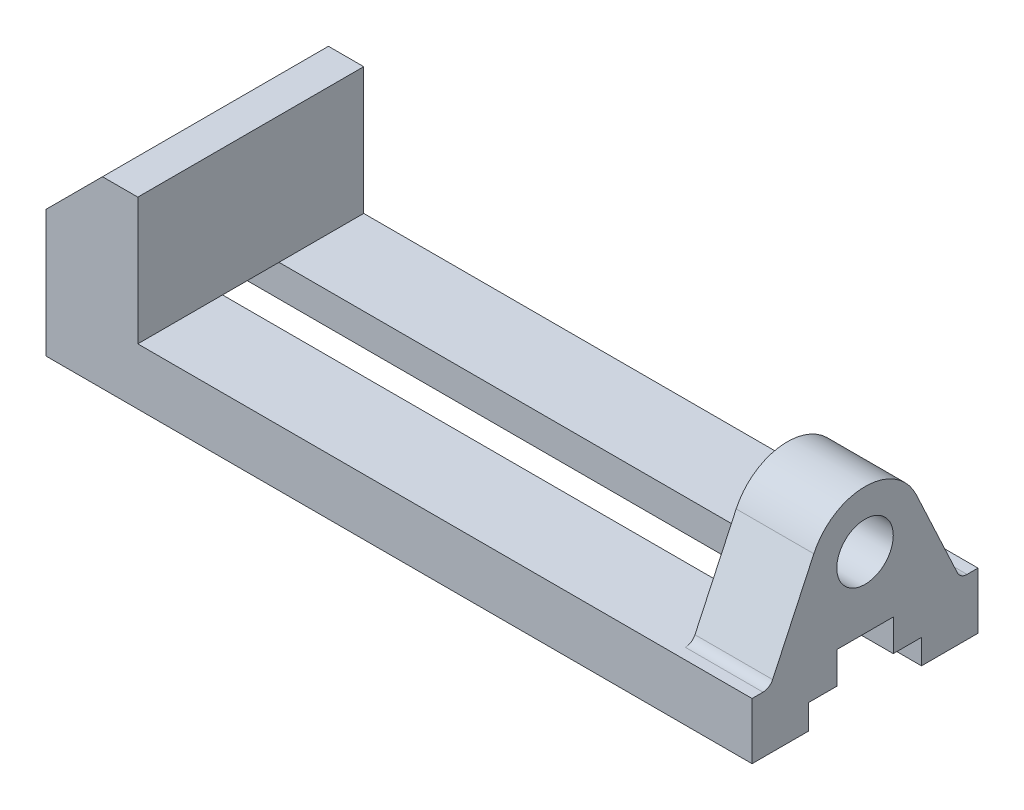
ISO-10303-21;
HEADER;
FILE_DESCRIPTION(('STEP AP214'),'2;1');
FILE_NAME('part.step','',(''),(''),'','','');
FILE_SCHEMA(('AUTOMOTIVE_DESIGN { 1 0 10303 214 1 1 1 1 }'));
ENDSEC;
DATA;
#1=APPLICATION_CONTEXT('core data for automotive mechanical design processes');
#2=APPLICATION_PROTOCOL_DEFINITION('international standard','automotive_design',2000,#1);
#3=PRODUCT_CONTEXT('',#1,'mechanical');
#4=PRODUCT('Part','Part','',(#3));
#5=PRODUCT_RELATED_PRODUCT_CATEGORY('part','',(#4));
#6=PRODUCT_DEFINITION_FORMATION('','',#4);
#7=PRODUCT_DEFINITION_CONTEXT('part definition',#1,'design');
#8=PRODUCT_DEFINITION('design','',#6,#7);
#9=PRODUCT_DEFINITION_SHAPE('','',#8);
#10=(LENGTH_UNIT() NAMED_UNIT(*) SI_UNIT(.MILLI.,.METRE.));
#11=(NAMED_UNIT(*) PLANE_ANGLE_UNIT() SI_UNIT($,.RADIAN.));
#12=(NAMED_UNIT(*) SI_UNIT($,.STERADIAN.) SOLID_ANGLE_UNIT());
#13=UNCERTAINTY_MEASURE_WITH_UNIT(LENGTH_MEASURE(1.E-05),#10,'distance_accuracy_value','');
#14=(GEOMETRIC_REPRESENTATION_CONTEXT(3) GLOBAL_UNCERTAINTY_ASSIGNED_CONTEXT((#13)) GLOBAL_UNIT_ASSIGNED_CONTEXT((#10,
#11,#12)) REPRESENTATION_CONTEXT('',''));
#15=CARTESIAN_POINT('',(0.,0.,0.));
#16=DIRECTION('',(0.,0.,1.));
#17=DIRECTION('',(1.,0.,0.));
#18=AXIS2_PLACEMENT_3D('',#15,#16,#17);
#19=CARTESIAN_POINT('',(0.,0.,32.));
#20=DIRECTION('',(0.,1.,0.));
#21=DIRECTION('',(0.,0.,1.));
#22=AXIS2_PLACEMENT_3D('',#19,#20,#21);
#23=PLANE('',#22);
#24=CARTESIAN_POINT('',(92.,0.,22.));
#25=DIRECTION('',(0.,1.,0.));
#26=DIRECTION('',(0.,0.,1.));
#27=AXIS2_PLACEMENT_3D('',#24,#25,#26);
#28=CIRCLE('',#27,3.);
#29=CARTESIAN_POINT('',(92.,0.,25.));
#30=VERTEX_POINT('',#29);
#31=EDGE_CURVE('E215',#30,#30,#28,.T.);
#32=ORIENTED_EDGE('',*,*,#31,.T.);
#33=EDGE_LOOP('',(#32));
#34=FACE_BOUND('',#33,.T.);
#35=CARTESIAN_POINT('',(162.,0.,22.));
#36=DIRECTION('',(0.,1.,0.));
#37=DIRECTION('',(0.,0.,1.));
#38=AXIS2_PLACEMENT_3D('',#35,#36,#37);
#39=CIRCLE('',#38,3.);
#40=CARTESIAN_POINT('',(162.,0.,25.));
#41=VERTEX_POINT('',#40);
#42=EDGE_CURVE('E227',#41,#41,#39,.T.);
#43=ORIENTED_EDGE('',*,*,#42,.T.);
#44=EDGE_LOOP('',(#43));
#45=FACE_BOUND('',#44,.T.);
#46=DIRECTION('',(0.,0.,-1.));
#47=VECTOR('',#46,1.);
#48=CARTESIAN_POINT('',(0.,0.,32.));
#49=LINE('',#48,#47);
#50=CARTESIAN_POINT('',(0.,0.,32.));
#51=VERTEX_POINT('',#50);
#52=CARTESIAN_POINT('',(0.,0.,16.));
#53=VERTEX_POINT('',#52);
#54=EDGE_CURVE('E380',#51,#53,#49,.T.);
#55=ORIENTED_EDGE('',*,*,#54,.T.);
#56=DIRECTION('',(1.,0.,0.));
#57=VECTOR('',#56,1.);
#58=CARTESIAN_POINT('',(0.,0.,16.));
#59=LINE('',#58,#57);
#60=CARTESIAN_POINT('',(200.,0.,16.));
#61=VERTEX_POINT('',#60);
#62=EDGE_CURVE('E270',#53,#61,#59,.T.);
#63=ORIENTED_EDGE('',*,*,#62,.T.);
#64=DIRECTION('',(0.,0.,-1.));
#65=VECTOR('',#64,1.);
#66=CARTESIAN_POINT('',(200.,0.,32.));
#67=LINE('',#66,#65);
#68=CARTESIAN_POINT('',(200.,0.,32.));
#69=VERTEX_POINT('',#68);
#70=EDGE_CURVE('E376',#69,#61,#67,.T.);
#71=ORIENTED_EDGE('',*,*,#70,.F.);
#72=DIRECTION('',(1.,0.,0.));
#73=VECTOR('',#72,1.);
#74=CARTESIAN_POINT('',(0.,0.,32.));
#75=LINE('',#74,#73);
#76=EDGE_CURVE('E329',#51,#69,#75,.T.);
#77=ORIENTED_EDGE('',*,*,#76,.F.);
#78=EDGE_LOOP('',(#55,#63,#71,#77));
#79=FACE_BOUND('',#78,.T.);
#80=ADVANCED_FACE('F32',(#34,#45,#79),#23,.F.);
#81=CARTESIAN_POINT('',(200.,16.,32.));
#82=DIRECTION('',(0.,-1.,0.));
#83=DIRECTION('',(1.,0.,0.));
#84=AXIS2_PLACEMENT_3D('',#81,#82,#83);
#85=PLANE('',#84);
#86=DIRECTION('',(0.,0.,-1.));
#87=VECTOR('',#86,1.);
#88=CARTESIAN_POINT('',(178.,16.,26.9801998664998));
#89=LINE('',#88,#87);
#90=CARTESIAN_POINT('',(178.,16.,28.8914106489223));
#91=VERTEX_POINT('',#90);
#92=CARTESIAN_POINT('',(178.,16.,8.));
#93=VERTEX_POINT('',#92);
#94=EDGE_CURVE('E308',#91,#93,#89,.T.);
#95=ORIENTED_EDGE('',*,*,#94,.T.);
#96=DIRECTION('',(1.,0.,0.));
#97=VECTOR('',#96,1.);
#98=CARTESIAN_POINT('',(0.,16.,8.));
#99=LINE('',#98,#97);
#100=CARTESIAN_POINT('',(26.,16.,8.));
#101=VERTEX_POINT('',#100);
#102=EDGE_CURVE('E55',#101,#93,#99,.T.);
#103=ORIENTED_EDGE('',*,*,#102,.F.);
#104=DIRECTION('',(0.,0.,-1.));
#105=VECTOR('',#104,1.);
#106=CARTESIAN_POINT('',(26.,16.,32.));
#107=LINE('',#106,#105);
#108=CARTESIAN_POINT('',(26.,16.,32.));
#109=VERTEX_POINT('',#108);
#110=EDGE_CURVE('E368',#109,#101,#107,.T.);
#111=ORIENTED_EDGE('',*,*,#110,.F.);
#112=DIRECTION('',(-1.,0.,0.));
#113=VECTOR('',#112,1.);
#114=CARTESIAN_POINT('',(200.,16.,32.));
#115=LINE('',#114,#113);
#116=CARTESIAN_POINT('',(200.,16.,32.));
#117=VERTEX_POINT('',#116);
#118=EDGE_CURVE('E334',#117,#109,#115,.T.);
#119=ORIENTED_EDGE('',*,*,#118,.F.);
#120=DIRECTION('',(0.,0.,-1.));
#121=VECTOR('',#120,1.);
#122=CARTESIAN_POINT('',(200.,16.,32.));
#123=LINE('',#122,#121);
#124=CARTESIAN_POINT('',(200.,16.,28.8914106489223));
#125=VERTEX_POINT('',#124);
#126=EDGE_CURVE('E372',#117,#125,#123,.T.);
#127=ORIENTED_EDGE('',*,*,#126,.T.);
#128=DIRECTION('',(1.,0.,0.));
#129=VECTOR('',#128,1.);
#130=CARTESIAN_POINT('',(200.,16.,28.8914106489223));
#131=LINE('',#130,#129);
#132=EDGE_CURVE('E383',#125,#91,#131,.F.);
#133=ORIENTED_EDGE('',*,*,#132,.T.);
#134=EDGE_LOOP('',(#95,#103,#111,#119,#127,#133));
#135=FACE_BOUND('',#134,.T.);
#136=ADVANCED_FACE('F408',(#135),#85,.F.);
#137=CARTESIAN_POINT('',(0.,36.,32.));
#138=DIRECTION('',(1.,0.,0.));
#139=DIRECTION('',(0.,1.,0.));
#140=AXIS2_PLACEMENT_3D('',#137,#138,#139);
#141=PLANE('',#140);
#142=DIRECTION('',(0.,0.,1.));
#143=VECTOR('',#142,1.);
#144=CARTESIAN_POINT('',(0.,7.,16.));
#145=LINE('',#144,#143);
#146=CARTESIAN_POINT('',(0.,7.,8.));
#147=VERTEX_POINT('',#146);
#148=CARTESIAN_POINT('',(0.,7.,16.));
#149=VERTEX_POINT('',#148);
#150=EDGE_CURVE('E247',#147,#149,#145,.T.);
#151=ORIENTED_EDGE('',*,*,#150,.T.);
#152=DIRECTION('',(0.,-1.,0.));
#153=VECTOR('',#152,1.);
#154=CARTESIAN_POINT('',(0.,0.,16.));
#155=LINE('',#154,#153);
#156=EDGE_CURVE('E250',#149,#53,#155,.T.);
#157=ORIENTED_EDGE('',*,*,#156,.T.);
#158=ORIENTED_EDGE('',*,*,#54,.F.);
#159=DIRECTION('',(0.,-1.,0.));
#160=VECTOR('',#159,1.);
#161=CARTESIAN_POINT('',(0.,36.,32.));
#162=LINE('',#161,#160);
#163=CARTESIAN_POINT('',(0.,36.,32.));
#164=VERTEX_POINT('',#163);
#165=EDGE_CURVE('E326',#164,#51,#162,.T.);
#166=ORIENTED_EDGE('',*,*,#165,.F.);
#167=DIRECTION('',(0.,0.,-1.));
#168=VECTOR('',#167,1.);
#169=CARTESIAN_POINT('',(0.,36.,32.));
#170=LINE('',#169,#168);
#171=CARTESIAN_POINT('',(0.,36.,-32.));
#172=VERTEX_POINT('',#171);
#173=EDGE_CURVE('E342',#164,#172,#170,.T.);
#174=ORIENTED_EDGE('',*,*,#173,.T.);
#175=DIRECTION('',(0.,-1.,0.));
#176=VECTOR('',#175,1.);
#177=CARTESIAN_POINT('',(0.,36.,-32.));
#178=LINE('',#177,#176);
#179=CARTESIAN_POINT('',(0.,0.,-32.));
#180=VERTEX_POINT('',#179);
#181=EDGE_CURVE('E324',#172,#180,#178,.T.);
#182=ORIENTED_EDGE('',*,*,#181,.T.);
#183=CARTESIAN_POINT('',(0.,0.,-16.));
#184=VERTEX_POINT('',#183);
#185=EDGE_CURVE('E379',#184,#180,#49,.T.);
#186=ORIENTED_EDGE('',*,*,#185,.F.);
#187=DIRECTION('',(0.,1.,0.));
#188=VECTOR('',#187,1.);
#189=CARTESIAN_POINT('',(0.,0.,-16.));
#190=LINE('',#189,#188);
#191=CARTESIAN_POINT('',(0.,7.,-16.));
#192=VERTEX_POINT('',#191);
#193=EDGE_CURVE('E231',#184,#192,#190,.T.);
#194=ORIENTED_EDGE('',*,*,#193,.T.);
#195=DIRECTION('',(0.,0.,1.));
#196=VECTOR('',#195,1.);
#197=CARTESIAN_POINT('',(0.,7.,-16.));
#198=LINE('',#197,#196);
#199=CARTESIAN_POINT('',(0.,7.,-8.));
#200=VERTEX_POINT('',#199);
#201=EDGE_CURVE('E234',#192,#200,#198,.T.);
#202=ORIENTED_EDGE('',*,*,#201,.T.);
#203=DIRECTION('',(0.,1.,0.));
#204=VECTOR('',#203,1.);
#205=CARTESIAN_POINT('',(0.,7.,-8.));
#206=LINE('',#205,#204);
#207=CARTESIAN_POINT('',(0.,16.,-8.));
#208=VERTEX_POINT('',#207);
#209=EDGE_CURVE('E238',#200,#208,#206,.T.);
#210=ORIENTED_EDGE('',*,*,#209,.T.);
#211=DIRECTION('',(0.,0.,1.));
#212=VECTOR('',#211,1.);
#213=CARTESIAN_POINT('',(0.,16.,8.));
#214=LINE('',#213,#212);
#215=CARTESIAN_POINT('',(0.,16.,8.));
#216=VERTEX_POINT('',#215);
#217=EDGE_CURVE('E241',#208,#216,#214,.T.);
#218=ORIENTED_EDGE('',*,*,#217,.T.);
#219=DIRECTION('',(0.,-1.,0.));
#220=VECTOR('',#219,1.);
#221=CARTESIAN_POINT('',(0.,7.,8.));
#222=LINE('',#221,#220);
#223=EDGE_CURVE('E244',#216,#147,#222,.T.);
#224=ORIENTED_EDGE('',*,*,#223,.T.);
#225=EDGE_LOOP('',(#151,#157,#158,#166,#174,#182,#186,#194,#202,#210,#218,#224));
#226=FACE_BOUND('',#225,.T.);
#227=ADVANCED_FACE('F466',(#226),#141,.F.);
#228=CARTESIAN_POINT('',(92.,0.,-22.));
#229=DIRECTION('',(0.,1.,0.));
#230=DIRECTION('',(0.,0.,1.));
#231=AXIS2_PLACEMENT_3D('',#228,#229,#230);
#232=CIRCLE('',#231,3.);
#233=CARTESIAN_POINT('',(92.,0.,-19.));
#234=VERTEX_POINT('',#233);
#235=EDGE_CURVE('E207',#234,#234,#232,.T.);
#236=ORIENTED_EDGE('',*,*,#235,.T.);
#237=EDGE_LOOP('',(#236));
#238=FACE_BOUND('',#237,.T.);
#239=CARTESIAN_POINT('',(162.,0.,-22.));
#240=DIRECTION('',(0.,1.,0.));
#241=DIRECTION('',(0.,0.,1.));
#242=AXIS2_PLACEMENT_3D('',#239,#240,#241);
#243=CIRCLE('',#242,3.);
#244=CARTESIAN_POINT('',(162.,0.,-19.));
#245=VERTEX_POINT('',#244);
#246=EDGE_CURVE('E221',#245,#245,#243,.T.);
#247=ORIENTED_EDGE('',*,*,#246,.T.);
#248=EDGE_LOOP('',(#247));
#249=FACE_BOUND('',#248,.T.);
#250=CARTESIAN_POINT('',(200.,0.,-16.));
#251=VERTEX_POINT('',#250);
#252=CARTESIAN_POINT('',(200.,0.,-32.));
#253=VERTEX_POINT('',#252);
#254=EDGE_CURVE('E375',#251,#253,#67,.T.);
#255=ORIENTED_EDGE('',*,*,#254,.F.);
#256=DIRECTION('',(1.,0.,0.));
#257=VECTOR('',#256,1.);
#258=CARTESIAN_POINT('',(0.,0.,-16.));
#259=LINE('',#258,#257);
#260=EDGE_CURVE('E47',#184,#251,#259,.T.);
#261=ORIENTED_EDGE('',*,*,#260,.F.);
#262=ORIENTED_EDGE('',*,*,#185,.T.);
#263=DIRECTION('',(1.,0.,0.));
#264=VECTOR('',#263,1.);
#265=CARTESIAN_POINT('',(0.,0.,-32.));
#266=LINE('',#265,#264);
#267=EDGE_CURVE('E345',#180,#253,#266,.T.);
#268=ORIENTED_EDGE('',*,*,#267,.T.);
#269=EDGE_LOOP('',(#255,#261,#262,#268));
#270=FACE_BOUND('',#269,.T.);
#271=ADVANCED_FACE('F490',(#238,#249,#270),#23,.F.);
#272=CARTESIAN_POINT('',(200.,0.,32.));
#273=DIRECTION('',(-1.,0.,0.));
#274=DIRECTION('',(0.,0.,1.));
#275=AXIS2_PLACEMENT_3D('',#272,#273,#274);
#276=PLANE('',#275);
#277=CARTESIAN_POINT('',(200.,36.,0.));
#278=DIRECTION('',(1.,0.,0.));
#279=DIRECTION('',(0.,0.,-1.));
#280=AXIS2_PLACEMENT_3D('',#277,#278,#279);
#281=CIRCLE('',#280,8.);
#282=CARTESIAN_POINT('',(200.,36.,-8.));
#283=VERTEX_POINT('',#282);
#284=EDGE_CURVE('E296',#283,#283,#281,.T.);
#285=ORIENTED_EDGE('',*,*,#284,.F.);
#286=EDGE_LOOP('',(#285));
#287=FACE_BOUND('',#286,.T.);
#288=ORIENTED_EDGE('',*,*,#70,.T.);
#289=DIRECTION('',(0.,-1.,0.));
#290=VECTOR('',#289,1.);
#291=CARTESIAN_POINT('',(200.,0.,16.));
#292=LINE('',#291,#290);
#293=CARTESIAN_POINT('',(200.,7.,16.));
#294=VERTEX_POINT('',#293);
#295=EDGE_CURVE('E235',#294,#61,#292,.T.);
#296=ORIENTED_EDGE('',*,*,#295,.F.);
#297=DIRECTION('',(0.,0.,1.));
#298=VECTOR('',#297,1.);
#299=CARTESIAN_POINT('',(200.,7.,16.));
#300=LINE('',#299,#298);
#301=CARTESIAN_POINT('',(200.,7.,8.));
#302=VERTEX_POINT('',#301);
#303=EDGE_CURVE('E266',#302,#294,#300,.T.);
#304=ORIENTED_EDGE('',*,*,#303,.F.);
#305=DIRECTION('',(0.,-1.,0.));
#306=VECTOR('',#305,1.);
#307=CARTESIAN_POINT('',(200.,7.,8.));
#308=LINE('',#307,#306);
#309=CARTESIAN_POINT('',(200.,16.,8.));
#310=VERTEX_POINT('',#309);
#311=EDGE_CURVE('E263',#310,#302,#308,.T.);
#312=ORIENTED_EDGE('',*,*,#311,.F.);
#313=DIRECTION('',(0.,0.,1.));
#314=VECTOR('',#313,1.);
#315=CARTESIAN_POINT('',(200.,16.,8.));
#316=LINE('',#315,#314);
#317=CARTESIAN_POINT('',(200.,16.,-8.));
#318=VERTEX_POINT('',#317);
#319=EDGE_CURVE('E260',#318,#310,#316,.T.);
#320=ORIENTED_EDGE('',*,*,#319,.F.);
#321=DIRECTION('',(0.,1.,0.));
#322=VECTOR('',#321,1.);
#323=CARTESIAN_POINT('',(200.,7.,-8.));
#324=LINE('',#323,#322);
#325=CARTESIAN_POINT('',(200.,7.,-8.));
#326=VERTEX_POINT('',#325);
#327=EDGE_CURVE('E257',#326,#318,#324,.T.);
#328=ORIENTED_EDGE('',*,*,#327,.F.);
#329=DIRECTION('',(0.,0.,1.));
#330=VECTOR('',#329,1.);
#331=CARTESIAN_POINT('',(200.,7.,-16.));
#332=LINE('',#331,#330);
#333=CARTESIAN_POINT('',(200.,7.,-16.));
#334=VERTEX_POINT('',#333);
#335=EDGE_CURVE('E254',#334,#326,#332,.T.);
#336=ORIENTED_EDGE('',*,*,#335,.F.);
#337=DIRECTION('',(0.,1.,0.));
#338=VECTOR('',#337,1.);
#339=CARTESIAN_POINT('',(200.,0.,-16.));
#340=LINE('',#339,#338);
#341=EDGE_CURVE('E230',#251,#334,#340,.T.);
#342=ORIENTED_EDGE('',*,*,#341,.F.);
#343=ORIENTED_EDGE('',*,*,#254,.T.);
#344=DIRECTION('',(0.,1.,0.));
#345=VECTOR('',#344,1.);
#346=CARTESIAN_POINT('',(200.,0.,-32.));
#347=LINE('',#346,#345);
#348=CARTESIAN_POINT('',(200.,16.,-32.));
#349=VERTEX_POINT('',#348);
#350=EDGE_CURVE('E348',#253,#349,#347,.T.);
#351=ORIENTED_EDGE('',*,*,#350,.T.);
#352=CARTESIAN_POINT('',(200.,16.,-28.8914106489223));
#353=VERTEX_POINT('',#352);
#354=EDGE_CURVE('E371',#353,#349,#123,.T.);
#355=ORIENTED_EDGE('',*,*,#354,.F.);
#356=CARTESIAN_POINT('',(200.,19.,-28.8914106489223));
#357=DIRECTION('',(-1.,0.,0.));
#358=DIRECTION('',(0.,0.,1.));
#359=AXIS2_PLACEMENT_3D('',#356,#357,#358);
#360=CIRCLE('',#359,3.);
#361=CARTESIAN_POINT('',(200.,17.7321452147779,-26.1724872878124));
#362=VERTEX_POINT('',#361);
#363=EDGE_CURVE('E394',#353,#362,#360,.T.);
#364=ORIENTED_EDGE('',*,*,#363,.T.);
#365=DIRECTION('',(0.,0.906307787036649,0.4226182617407));
#366=VECTOR('',#365,1.);
#367=CARTESIAN_POINT('',(200.,42.7618921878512,-14.5009245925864));
#368=LINE('',#367,#366);
#369=CARTESIAN_POINT('',(200.,42.7618921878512,-14.5009245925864));
#370=VERTEX_POINT('',#369);
#371=EDGE_CURVE('E304',#362,#370,#368,.T.);
#372=ORIENTED_EDGE('',*,*,#371,.T.);
#373=CARTESIAN_POINT('',(200.,36.,0.));
#374=DIRECTION('',(1.,0.,0.));
#375=DIRECTION('',(0.,0.,-1.));
#376=AXIS2_PLACEMENT_3D('',#373,#374,#375);
#377=CIRCLE('',#376,16.);
#378=CARTESIAN_POINT('',(200.,42.7618921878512,14.5009245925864));
#379=VERTEX_POINT('',#378);
#380=EDGE_CURVE('E299',#370,#379,#377,.T.);
#381=ORIENTED_EDGE('',*,*,#380,.T.);
#382=DIRECTION('',(0.,-0.90630778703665,0.4226182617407));
#383=VECTOR('',#382,1.);
#384=CARTESIAN_POINT('',(200.,42.7618921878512,14.5009245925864));
#385=LINE('',#384,#383);
#386=CARTESIAN_POINT('',(200.,17.7321452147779,26.1724872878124));
#387=VERTEX_POINT('',#386);
#388=EDGE_CURVE('E317',#379,#387,#385,.T.);
#389=ORIENTED_EDGE('',*,*,#388,.T.);
#390=CARTESIAN_POINT('',(200.,19.,28.8914106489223));
#391=DIRECTION('',(-1.,0.,0.));
#392=DIRECTION('',(0.,0.,1.));
#393=AXIS2_PLACEMENT_3D('',#390,#391,#392);
#394=CIRCLE('',#393,3.);
#395=EDGE_CURVE('E40',#387,#125,#394,.T.);
#396=ORIENTED_EDGE('',*,*,#395,.T.);
#397=ORIENTED_EDGE('',*,*,#126,.F.);
#398=DIRECTION('',(0.,1.,0.));
#399=VECTOR('',#398,1.);
#400=CARTESIAN_POINT('',(200.,0.,32.));
#401=LINE('',#400,#399);
#402=EDGE_CURVE('E332',#69,#117,#401,.T.);
#403=ORIENTED_EDGE('',*,*,#402,.F.);
#404=EDGE_LOOP('',(#288,#296,#304,#312,#320,#328,#336,#342,#343,#351,#355,#364,#372,#381,#389,
#396,#397,#403));
#405=FACE_BOUND('',#404,.T.);
#406=ADVANCED_FACE('F400',(#287,#405),#276,.F.);
#407=CARTESIAN_POINT('',(26.,16.,-8.));
#408=VERTEX_POINT('',#407);
#409=CARTESIAN_POINT('',(26.,16.,-32.));
#410=VERTEX_POINT('',#409);
#411=EDGE_CURVE('E367',#408,#410,#107,.T.);
#412=ORIENTED_EDGE('',*,*,#411,.F.);
#413=DIRECTION('',(1.,0.,0.));
#414=VECTOR('',#413,1.);
#415=CARTESIAN_POINT('',(0.,16.,-8.));
#416=LINE('',#415,#414);
#417=CARTESIAN_POINT('',(178.,16.,-8.));
#418=VERTEX_POINT('',#417);
#419=EDGE_CURVE('E284',#408,#418,#416,.T.);
#420=ORIENTED_EDGE('',*,*,#419,.T.);
#421=CARTESIAN_POINT('',(178.,16.,-28.8914106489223));
#422=VERTEX_POINT('',#421);
#423=EDGE_CURVE('E307',#418,#422,#89,.T.);
#424=ORIENTED_EDGE('',*,*,#423,.T.);
#425=DIRECTION('',(1.,0.,0.));
#426=VECTOR('',#425,1.);
#427=CARTESIAN_POINT('',(200.,16.,-28.8914106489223));
#428=LINE('',#427,#426);
#429=EDGE_CURVE('E386',#422,#353,#428,.T.);
#430=ORIENTED_EDGE('',*,*,#429,.T.);
#431=ORIENTED_EDGE('',*,*,#354,.T.);
#432=DIRECTION('',(-1.,0.,0.));
#433=VECTOR('',#432,1.);
#434=CARTESIAN_POINT('',(200.,16.,-32.));
#435=LINE('',#434,#433);
#436=EDGE_CURVE('E351',#349,#410,#435,.T.);
#437=ORIENTED_EDGE('',*,*,#436,.T.);
#438=EDGE_LOOP('',(#412,#420,#424,#430,#431,#437));
#439=FACE_BOUND('',#438,.T.);
#440=ADVANCED_FACE('F433',(#439),#85,.F.);
#441=CARTESIAN_POINT('',(26.,16.,32.));
#442=DIRECTION('',(-1.,0.,0.));
#443=DIRECTION('',(0.,-1.,0.));
#444=AXIS2_PLACEMENT_3D('',#441,#442,#443);
#445=PLANE('',#444);
#446=DIRECTION('',(0.,1.,0.));
#447=VECTOR('',#446,1.);
#448=CARTESIAN_POINT('',(26.,16.,-32.));
#449=LINE('',#448,#447);
#450=CARTESIAN_POINT('',(26.,52.,-32.));
#451=VERTEX_POINT('',#450);
#452=EDGE_CURVE('E354',#410,#451,#449,.T.);
#453=ORIENTED_EDGE('',*,*,#452,.T.);
#454=DIRECTION('',(0.,0.,-1.));
#455=VECTOR('',#454,1.);
#456=CARTESIAN_POINT('',(26.,52.,32.));
#457=LINE('',#456,#455);
#458=CARTESIAN_POINT('',(26.,52.,32.));
#459=VERTEX_POINT('',#458);
#460=EDGE_CURVE('E364',#459,#451,#457,.T.);
#461=ORIENTED_EDGE('',*,*,#460,.F.);
#462=DIRECTION('',(0.,1.,0.));
#463=VECTOR('',#462,1.);
#464=CARTESIAN_POINT('',(26.,16.,32.));
#465=LINE('',#464,#463);
#466=EDGE_CURVE('E336',#109,#459,#465,.T.);
#467=ORIENTED_EDGE('',*,*,#466,.F.);
#468=ORIENTED_EDGE('',*,*,#110,.T.);
#469=DIRECTION('',(0.,0.,-1.));
#470=VECTOR('',#469,1.);
#471=CARTESIAN_POINT('',(26.,16.,32.));
#472=LINE('',#471,#470);
#473=EDGE_CURVE('E273',#101,#408,#472,.T.);
#474=ORIENTED_EDGE('',*,*,#473,.T.);
#475=ORIENTED_EDGE('',*,*,#411,.T.);
#476=EDGE_LOOP('',(#453,#461,#467,#468,#474,#475));
#477=FACE_BOUND('',#476,.T.);
#478=ADVANCED_FACE('F446',(#477),#445,.F.);
#479=CARTESIAN_POINT('',(26.,52.,32.));
#480=DIRECTION('',(0.,-1.,0.));
#481=DIRECTION('',(0.,0.,-1.));
#482=AXIS2_PLACEMENT_3D('',#479,#480,#481);
#483=PLANE('',#482);
#484=DIRECTION('',(-1.,0.,0.));
#485=VECTOR('',#484,1.);
#486=CARTESIAN_POINT('',(26.,52.,-32.));
#487=LINE('',#486,#485);
#488=CARTESIAN_POINT('',(16.,52.,-32.));
#489=VERTEX_POINT('',#488);
#490=EDGE_CURVE('E356',#451,#489,#487,.T.);
#491=ORIENTED_EDGE('',*,*,#490,.T.);
#492=DIRECTION('',(0.,0.,-1.));
#493=VECTOR('',#492,1.);
#494=CARTESIAN_POINT('',(16.,52.,32.));
#495=LINE('',#494,#493);
#496=CARTESIAN_POINT('',(16.,52.,32.));
#497=VERTEX_POINT('',#496);
#498=EDGE_CURVE('E361',#497,#489,#495,.T.);
#499=ORIENTED_EDGE('',*,*,#498,.F.);
#500=DIRECTION('',(-1.,0.,0.));
#501=VECTOR('',#500,1.);
#502=CARTESIAN_POINT('',(26.,52.,32.));
#503=LINE('',#502,#501);
#504=EDGE_CURVE('E338',#459,#497,#503,.T.);
#505=ORIENTED_EDGE('',*,*,#504,.F.);
#506=ORIENTED_EDGE('',*,*,#460,.T.);
#507=EDGE_LOOP('',(#491,#499,#505,#506));
#508=FACE_BOUND('',#507,.T.);
#509=ADVANCED_FACE('F519',(#508),#483,.F.);
#510=CARTESIAN_POINT('',(16.,52.,32.));
#511=DIRECTION('',(0.707106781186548,-0.707106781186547,0.));
#512=DIRECTION('',(0.707106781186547,0.707106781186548,0.));
#513=AXIS2_PLACEMENT_3D('',#510,#511,#512);
#514=PLANE('',#513);
#515=DIRECTION('',(-0.707106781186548,-0.707106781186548,0.));
#516=VECTOR('',#515,1.);
#517=CARTESIAN_POINT('',(16.,52.,-32.));
#518=LINE('',#517,#516);
#519=EDGE_CURVE('E330',#489,#172,#518,.T.);
#520=ORIENTED_EDGE('',*,*,#519,.T.);
#521=ORIENTED_EDGE('',*,*,#173,.F.);
#522=DIRECTION('',(-0.707106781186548,-0.707106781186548,0.));
#523=VECTOR('',#522,1.);
#524=CARTESIAN_POINT('',(16.,52.,32.));
#525=LINE('',#524,#523);
#526=EDGE_CURVE('E340',#497,#164,#525,.T.);
#527=ORIENTED_EDGE('',*,*,#526,.F.);
#528=ORIENTED_EDGE('',*,*,#498,.T.);
#529=EDGE_LOOP('',(#520,#521,#527,#528));
#530=FACE_BOUND('',#529,.T.);
#531=ADVANCED_FACE('F516',(#530),#514,.F.);
#532=CARTESIAN_POINT('',(0.,0.,32.));
#533=DIRECTION('',(0.,0.,1.));
#534=DIRECTION('',(1.,0.,0.));
#535=AXIS2_PLACEMENT_3D('',#532,#533,#534);
#536=PLANE('',#535);
#537=ORIENTED_EDGE('',*,*,#165,.T.);
#538=ORIENTED_EDGE('',*,*,#76,.T.);
#539=ORIENTED_EDGE('',*,*,#402,.T.);
#540=ORIENTED_EDGE('',*,*,#118,.T.);
#541=ORIENTED_EDGE('',*,*,#466,.T.);
#542=ORIENTED_EDGE('',*,*,#504,.T.);
#543=ORIENTED_EDGE('',*,*,#526,.T.);
#544=EDGE_LOOP('',(#537,#538,#539,#540,#541,#542,#543));
#545=FACE_BOUND('',#544,.T.);
#546=ADVANCED_FACE('F523',(#545),#536,.T.);
#547=CARTESIAN_POINT('',(0.,0.,-32.));
#548=DIRECTION('',(0.,0.,1.));
#549=DIRECTION('',(1.,0.,0.));
#550=AXIS2_PLACEMENT_3D('',#547,#548,#549);
#551=PLANE('',#550);
#552=ORIENTED_EDGE('',*,*,#181,.F.);
#553=ORIENTED_EDGE('',*,*,#519,.F.);
#554=ORIENTED_EDGE('',*,*,#490,.F.);
#555=ORIENTED_EDGE('',*,*,#452,.F.);
#556=ORIENTED_EDGE('',*,*,#436,.F.);
#557=ORIENTED_EDGE('',*,*,#350,.F.);
#558=ORIENTED_EDGE('',*,*,#267,.F.);
#559=EDGE_LOOP('',(#552,#553,#554,#555,#556,#557,#558));
#560=FACE_BOUND('',#559,.T.);
#561=ADVANCED_FACE('F443',(#560),#551,.F.);
#562=CARTESIAN_POINT('',(178.,36.,0.));
#563=DIRECTION('',(1.,0.,0.));
#564=DIRECTION('',(0.,0.,-1.));
#565=AXIS2_PLACEMENT_3D('',#562,#563,#564);
#566=CYLINDRICAL_SURFACE('',#565,16.);
#567=ORIENTED_EDGE('',*,*,#380,.F.);
#568=DIRECTION('',(1.,0.,0.));
#569=VECTOR('',#568,1.);
#570=CARTESIAN_POINT('',(178.,42.7618921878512,-14.5009245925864));
#571=LINE('',#570,#569);
#572=CARTESIAN_POINT('',(178.,42.7618921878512,-14.5009245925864));
#573=VERTEX_POINT('',#572);
#574=EDGE_CURVE('E321',#573,#370,#571,.T.);
#575=ORIENTED_EDGE('',*,*,#574,.F.);
#576=CARTESIAN_POINT('',(178.,36.,0.));
#577=DIRECTION('',(1.,0.,0.));
#578=DIRECTION('',(0.,0.,-1.));
#579=AXIS2_PLACEMENT_3D('',#576,#577,#578);
#580=CIRCLE('',#579,16.);
#581=CARTESIAN_POINT('',(178.,42.7618921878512,14.5009245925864));
#582=VERTEX_POINT('',#581);
#583=EDGE_CURVE('E300',#573,#582,#580,.T.);
#584=ORIENTED_EDGE('',*,*,#583,.T.);
#585=DIRECTION('',(1.,0.,0.));
#586=VECTOR('',#585,1.);
#587=CARTESIAN_POINT('',(178.,42.7618921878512,14.5009245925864));
#588=LINE('',#587,#586);
#589=EDGE_CURVE('E314',#582,#379,#588,.T.);
#590=ORIENTED_EDGE('',*,*,#589,.T.);
#591=EDGE_LOOP('',(#567,#575,#584,#590));
#592=FACE_BOUND('',#591,.T.);
#593=ADVANCED_FACE('F420',(#592),#566,.T.);
#594=CARTESIAN_POINT('',(178.,42.7618921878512,-14.5009245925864));
#595=DIRECTION('',(0.,0.4226182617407,-0.90630778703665));
#596=DIRECTION('',(0.,0.90630778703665,0.4226182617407));
#597=AXIS2_PLACEMENT_3D('',#594,#595,#596);
#598=PLANE('',#597);
#599=ORIENTED_EDGE('',*,*,#371,.F.);
#600=DIRECTION('',(1.,0.,0.));
#601=VECTOR('',#600,1.);
#602=CARTESIAN_POINT('',(178.,17.7321452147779,-26.1724872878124));
#603=LINE('',#602,#601);
#604=CARTESIAN_POINT('',(178.,17.7321452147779,-26.1724872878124));
#605=VERTEX_POINT('',#604);
#606=EDGE_CURVE('E389',#362,#605,#603,.F.);
#607=ORIENTED_EDGE('',*,*,#606,.T.);
#608=DIRECTION('',(0.,0.906307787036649,0.4226182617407));
#609=VECTOR('',#608,1.);
#610=CARTESIAN_POINT('',(178.,42.7618921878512,-14.5009245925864));
#611=LINE('',#610,#609);
#612=EDGE_CURVE('E311',#605,#573,#611,.T.);
#613=ORIENTED_EDGE('',*,*,#612,.T.);
#614=ORIENTED_EDGE('',*,*,#574,.T.);
#615=EDGE_LOOP('',(#599,#607,#613,#614));
#616=FACE_BOUND('',#615,.T.);
#617=ADVANCED_FACE('F704',(#616),#598,.T.);
#618=CARTESIAN_POINT('',(178.,42.7618921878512,14.5009245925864));
#619=DIRECTION('',(0.,0.4226182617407,0.90630778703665));
#620=DIRECTION('',(0.,-0.90630778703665,0.4226182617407));
#621=AXIS2_PLACEMENT_3D('',#618,#619,#620);
#622=PLANE('',#621);
#623=DIRECTION('',(0.,-0.90630778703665,0.4226182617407));
#624=VECTOR('',#623,1.);
#625=CARTESIAN_POINT('',(178.,42.7618921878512,14.5009245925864));
#626=LINE('',#625,#624);
#627=CARTESIAN_POINT('',(178.,17.7321452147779,26.1724872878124));
#628=VERTEX_POINT('',#627);
#629=EDGE_CURVE('E303',#582,#628,#626,.T.);
#630=ORIENTED_EDGE('',*,*,#629,.T.);
#631=DIRECTION('',(1.,0.,0.));
#632=VECTOR('',#631,1.);
#633=CARTESIAN_POINT('',(178.,17.7321452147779,26.1724872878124));
#634=LINE('',#633,#632);
#635=EDGE_CURVE('E391',#628,#387,#634,.T.);
#636=ORIENTED_EDGE('',*,*,#635,.T.);
#637=ORIENTED_EDGE('',*,*,#388,.F.);
#638=ORIENTED_EDGE('',*,*,#589,.F.);
#639=EDGE_LOOP('',(#630,#636,#637,#638));
#640=FACE_BOUND('',#639,.T.);
#641=ADVANCED_FACE('F417',(#640),#622,.T.);
#642=CARTESIAN_POINT('',(178.,36.,0.));
#643=DIRECTION('',(1.,0.,0.));
#644=DIRECTION('',(0.,0.,-1.));
#645=AXIS2_PLACEMENT_3D('',#642,#643,#644);
#646=PLANE('',#645);
#647=CARTESIAN_POINT('',(178.,36.,0.));
#648=DIRECTION('',(1.,0.,0.));
#649=DIRECTION('',(0.,0.,-1.));
#650=AXIS2_PLACEMENT_3D('',#647,#648,#649);
#651=CIRCLE('',#650,8.);
#652=CARTESIAN_POINT('',(178.,36.,-8.));
#653=VERTEX_POINT('',#652);
#654=EDGE_CURVE('E293',#653,#653,#651,.F.);
#655=ORIENTED_EDGE('',*,*,#654,.F.);
#656=EDGE_LOOP('',(#655));
#657=FACE_BOUND('',#656,.T.);
#658=ORIENTED_EDGE('',*,*,#583,.F.);
#659=ORIENTED_EDGE('',*,*,#612,.F.);
#660=CARTESIAN_POINT('',(178.,19.,-28.8914106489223));
#661=DIRECTION('',(1.,0.,0.));
#662=DIRECTION('',(0.,0.,-1.));
#663=AXIS2_PLACEMENT_3D('',#660,#661,#662);
#664=CIRCLE('',#663,3.);
#665=EDGE_CURVE('E396',#605,#422,#664,.T.);
#666=ORIENTED_EDGE('',*,*,#665,.T.);
#667=ORIENTED_EDGE('',*,*,#423,.F.);
#668=EDGE_CURVE('E312',#93,#418,#89,.T.);
#669=ORIENTED_EDGE('',*,*,#668,.F.);
#670=ORIENTED_EDGE('',*,*,#94,.F.);
#671=CARTESIAN_POINT('',(178.,19.,28.8914106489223));
#672=DIRECTION('',(1.,0.,0.));
#673=DIRECTION('',(0.,0.,-1.));
#674=AXIS2_PLACEMENT_3D('',#671,#672,#673);
#675=CIRCLE('',#674,3.);
#676=EDGE_CURVE('E11',#91,#628,#675,.T.);
#677=ORIENTED_EDGE('',*,*,#676,.T.);
#678=ORIENTED_EDGE('',*,*,#629,.F.);
#679=EDGE_LOOP('',(#658,#659,#666,#667,#669,#670,#677,#678));
#680=FACE_BOUND('',#679,.T.);
#681=ADVANCED_FACE('F414',(#657,#680),#646,.F.);
#682=CARTESIAN_POINT('',(200.,19.,-28.8914106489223));
#683=DIRECTION('',(1.,0.,0.));
#684=DIRECTION('',(0.,1.,0.));
#685=AXIS2_PLACEMENT_3D('',#682,#683,#684);
#686=CYLINDRICAL_SURFACE('',#685,3.);
#687=ORIENTED_EDGE('',*,*,#665,.F.);
#688=ORIENTED_EDGE('',*,*,#606,.F.);
#689=ORIENTED_EDGE('',*,*,#363,.F.);
#690=ORIENTED_EDGE('',*,*,#429,.F.);
#691=EDGE_LOOP('',(#687,#688,#689,#690));
#692=FACE_BOUND('',#691,.T.);
#693=ADVANCED_FACE('F429',(#692),#686,.F.);
#694=CARTESIAN_POINT('',(178.,19.,28.8914106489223));
#695=DIRECTION('',(1.,0.,0.));
#696=DIRECTION('',(0.,1.,0.));
#697=AXIS2_PLACEMENT_3D('',#694,#695,#696);
#698=CYLINDRICAL_SURFACE('',#697,3.);
#699=ORIENTED_EDGE('',*,*,#676,.F.);
#700=ORIENTED_EDGE('',*,*,#132,.F.);
#701=ORIENTED_EDGE('',*,*,#395,.F.);
#702=ORIENTED_EDGE('',*,*,#635,.F.);
#703=EDGE_LOOP('',(#699,#700,#701,#702));
#704=FACE_BOUND('',#703,.T.);
#705=ADVANCED_FACE('F34',(#704),#698,.F.);
#706=CARTESIAN_POINT('',(-0.001000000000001,36.,0.));
#707=DIRECTION('',(1.,0.,0.));
#708=DIRECTION('',(0.,0.,-1.));
#709=AXIS2_PLACEMENT_3D('',#706,#707,#708);
#710=CYLINDRICAL_SURFACE('',#709,8.);
#711=CARTESIAN_POINT('',(200.,36.,-8.));
#712=CARTESIAN_POINT('',(199.770833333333,36.,-8.));
#713=CARTESIAN_POINT('',(199.541666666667,36.,-8.));
#714=CARTESIAN_POINT('',(199.083333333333,36.,-8.));
#715=CARTESIAN_POINT('',(198.854166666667,36.,-8.));
#716=CARTESIAN_POINT('',(198.395833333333,36.,-8.));
#717=CARTESIAN_POINT('',(198.166666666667,36.,-8.));
#718=CARTESIAN_POINT('',(197.708333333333,36.,-8.));
#719=CARTESIAN_POINT('',(197.479166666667,36.,-8.));
#720=CARTESIAN_POINT('',(197.020833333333,36.,-8.));
#721=CARTESIAN_POINT('',(196.791666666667,36.,-8.));
#722=CARTESIAN_POINT('',(196.333333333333,36.,-8.));
#723=CARTESIAN_POINT('',(196.104166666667,36.,-8.));
#724=CARTESIAN_POINT('',(195.645833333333,36.,-8.));
#725=CARTESIAN_POINT('',(195.416666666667,36.,-8.));
#726=CARTESIAN_POINT('',(194.958333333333,36.,-8.));
#727=CARTESIAN_POINT('',(194.729166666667,36.,-8.));
#728=CARTESIAN_POINT('',(194.270833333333,36.,-8.));
#729=CARTESIAN_POINT('',(194.041666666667,36.,-8.));
#730=CARTESIAN_POINT('',(193.583333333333,36.,-8.));
#731=CARTESIAN_POINT('',(193.354166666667,36.,-8.));
#732=CARTESIAN_POINT('',(192.895833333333,36.,-8.));
#733=CARTESIAN_POINT('',(192.666666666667,36.,-8.));
#734=CARTESIAN_POINT('',(192.208333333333,36.,-8.));
#735=CARTESIAN_POINT('',(191.979166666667,36.,-8.));
#736=CARTESIAN_POINT('',(191.520833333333,36.,-8.));
#737=CARTESIAN_POINT('',(191.291666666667,36.,-8.));
#738=CARTESIAN_POINT('',(190.833333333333,36.,-8.));
#739=CARTESIAN_POINT('',(190.604166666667,36.,-8.));
#740=CARTESIAN_POINT('',(190.145833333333,36.,-8.));
#741=CARTESIAN_POINT('',(189.916666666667,36.,-8.));
#742=CARTESIAN_POINT('',(189.458333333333,36.,-8.));
#743=CARTESIAN_POINT('',(189.229166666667,36.,-8.));
#744=CARTESIAN_POINT('',(188.770833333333,36.,-8.));
#745=CARTESIAN_POINT('',(188.541666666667,36.,-8.));
#746=CARTESIAN_POINT('',(188.083333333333,36.,-8.));
#747=CARTESIAN_POINT('',(187.854166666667,36.,-8.));
#748=CARTESIAN_POINT('',(187.395833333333,36.,-8.));
#749=CARTESIAN_POINT('',(187.166666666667,36.,-8.));
#750=CARTESIAN_POINT('',(186.708333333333,36.,-8.));
#751=CARTESIAN_POINT('',(186.479166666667,36.,-8.));
#752=CARTESIAN_POINT('',(186.020833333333,36.,-8.));
#753=CARTESIAN_POINT('',(185.791666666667,36.,-8.));
#754=CARTESIAN_POINT('',(185.333333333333,36.,-8.));
#755=CARTESIAN_POINT('',(185.104166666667,36.,-8.));
#756=CARTESIAN_POINT('',(184.645833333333,36.,-8.));
#757=CARTESIAN_POINT('',(184.416666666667,36.,-8.));
#758=CARTESIAN_POINT('',(183.958333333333,36.,-8.));
#759=CARTESIAN_POINT('',(183.729166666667,36.,-8.));
#760=CARTESIAN_POINT('',(183.270833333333,36.,-8.));
#761=CARTESIAN_POINT('',(183.041666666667,36.,-8.));
#762=CARTESIAN_POINT('',(182.583333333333,36.,-8.));
#763=CARTESIAN_POINT('',(182.354166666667,36.,-8.));
#764=CARTESIAN_POINT('',(181.895833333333,36.,-8.));
#765=CARTESIAN_POINT('',(181.666666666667,36.,-8.));
#766=CARTESIAN_POINT('',(181.208333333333,36.,-8.));
#767=CARTESIAN_POINT('',(180.979166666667,36.,-8.));
#768=CARTESIAN_POINT('',(180.520833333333,36.,-8.));
#769=CARTESIAN_POINT('',(180.291666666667,36.,-8.));
#770=CARTESIAN_POINT('',(179.833333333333,36.,-8.));
#771=CARTESIAN_POINT('',(179.604166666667,36.,-8.));
#772=CARTESIAN_POINT('',(179.145833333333,36.,-8.));
#773=CARTESIAN_POINT('',(178.916666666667,36.,-8.));
#774=CARTESIAN_POINT('',(178.458333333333,36.,-8.));
#775=CARTESIAN_POINT('',(178.229166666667,36.,-8.));
#776=CARTESIAN_POINT('',(178.,36.,-8.));
#777=B_SPLINE_CURVE_WITH_KNOTS('',3,(#711,#712,#713,#714,#715,#716,#717,#718,#719,#720,#721,
#722,#723,#724,#725,#726,#727,#728,#729,#730,#731,#732,#733,#734,#735,#736,#737,#738,#739,#740,
#741,#742,#743,#744,#745,#746,#747,#748,#749,#750,#751,#752,#753,#754,#755,#756,#757,#758,#759,
#760,#761,#762,#763,#764,#765,#766,#767,#768,#769,#770,#771,#772,#773,#774,#775,#776),
.UNSPECIFIED.,.F.,.F.,(4,2,2,2,2,2,2,2,2,2,2,2,2,2,2,2,2,2,2,2,2,2,2,2,2,2,2,2,2,2,2,2,4),(0.,
0.687500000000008,1.37500000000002,2.06249999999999,2.75,3.43750000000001,4.12499999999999,
4.8125,5.50000000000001,6.18750000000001,6.87500000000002,7.5625,8.25000000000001,
8.93750000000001,9.62499999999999,10.3125,11.,11.6875,12.375,13.0625,13.75,14.4375,15.125,
15.8125,16.5,17.1875,17.875,18.5625,19.25,19.9375,20.625,21.3125,22.),.UNSPECIFIED.);
#778=EDGE_CURVE('BSEAM541',#283,#653,#777,.T.);
#779=ORIENTED_EDGE('',*,*,#284,.T.);
#780=ORIENTED_EDGE('',*,*,#654,.T.);
#781=ORIENTED_EDGE('',*,*,#778,.T.);
#782=ORIENTED_EDGE('',*,*,#778,.F.);
#783=EDGE_LOOP('',(#779,#781,#780,#782));
#784=FACE_BOUND('',#783,.T.);
#785=ADVANCED_FACE('F541',(#784),#710,.F.);
#786=CARTESIAN_POINT('',(0.,16.,8.));
#787=DIRECTION('',(0.,1.,0.));
#788=DIRECTION('',(0.,0.,1.));
#789=AXIS2_PLACEMENT_3D('',#786,#787,#788);
#790=PLANE('',#789);
#791=EDGE_CURVE('E278',#216,#101,#99,.T.);
#792=ORIENTED_EDGE('',*,*,#791,.F.);
#793=ORIENTED_EDGE('',*,*,#217,.F.);
#794=EDGE_CURVE('E281',#208,#408,#416,.T.);
#795=ORIENTED_EDGE('',*,*,#794,.T.);
#796=ORIENTED_EDGE('',*,*,#473,.F.);
#797=EDGE_LOOP('',(#792,#793,#795,#796));
#798=FACE_BOUND('',#797,.T.);
#799=ADVANCED_FACE('F449',(#798),#790,.F.);
#800=EDGE_CURVE('E285',#418,#318,#416,.T.);
#801=ORIENTED_EDGE('',*,*,#800,.T.);
#802=ORIENTED_EDGE('',*,*,#319,.T.);
#803=EDGE_CURVE('E280',#93,#310,#99,.T.);
#804=ORIENTED_EDGE('',*,*,#803,.F.);
#805=ORIENTED_EDGE('',*,*,#668,.T.);
#806=EDGE_LOOP('',(#801,#802,#804,#805));
#807=FACE_BOUND('',#806,.T.);
#808=ADVANCED_FACE('F457',(#807),#790,.F.);
#809=CARTESIAN_POINT('',(0.,0.,16.));
#810=DIRECTION('',(0.,0.,1.));
#811=DIRECTION('',(1.,0.,0.));
#812=AXIS2_PLACEMENT_3D('',#809,#810,#811);
#813=PLANE('',#812);
#814=ORIENTED_EDGE('',*,*,#295,.T.);
#815=ORIENTED_EDGE('',*,*,#62,.F.);
#816=ORIENTED_EDGE('',*,*,#156,.F.);
#817=DIRECTION('',(1.,0.,0.));
#818=VECTOR('',#817,1.);
#819=CARTESIAN_POINT('',(0.,7.,16.));
#820=LINE('',#819,#818);
#821=EDGE_CURVE('E274',#149,#294,#820,.T.);
#822=ORIENTED_EDGE('',*,*,#821,.T.);
#823=EDGE_LOOP('',(#814,#815,#816,#822));
#824=FACE_BOUND('',#823,.T.);
#825=ADVANCED_FACE('F527',(#824),#813,.F.);
#826=CARTESIAN_POINT('',(0.,7.,16.));
#827=DIRECTION('',(0.,1.,0.));
#828=DIRECTION('',(0.,0.,1.));
#829=AXIS2_PLACEMENT_3D('',#826,#827,#828);
#830=PLANE('',#829);
#831=ORIENTED_EDGE('',*,*,#303,.T.);
#832=ORIENTED_EDGE('',*,*,#821,.F.);
#833=ORIENTED_EDGE('',*,*,#150,.F.);
#834=DIRECTION('',(1.,0.,0.));
#835=VECTOR('',#834,1.);
#836=CARTESIAN_POINT('',(0.,7.,8.));
#837=LINE('',#836,#835);
#838=EDGE_CURVE('E276',#147,#302,#837,.T.);
#839=ORIENTED_EDGE('',*,*,#838,.T.);
#840=EDGE_LOOP('',(#831,#832,#833,#839));
#841=FACE_BOUND('',#840,.T.);
#842=ADVANCED_FACE('F462',(#841),#830,.F.);
#843=CARTESIAN_POINT('',(0.,7.,8.));
#844=DIRECTION('',(0.,0.,1.));
#845=DIRECTION('',(1.,0.,0.));
#846=AXIS2_PLACEMENT_3D('',#843,#844,#845);
#847=PLANE('',#846);
#848=ORIENTED_EDGE('',*,*,#311,.T.);
#849=ORIENTED_EDGE('',*,*,#838,.F.);
#850=ORIENTED_EDGE('',*,*,#223,.F.);
#851=ORIENTED_EDGE('',*,*,#791,.T.);
#852=ORIENTED_EDGE('',*,*,#102,.T.);
#853=ORIENTED_EDGE('',*,*,#803,.T.);
#854=EDGE_LOOP('',(#848,#849,#850,#851,#852,#853));
#855=FACE_BOUND('',#854,.T.);
#856=ADVANCED_FACE('F452',(#855),#847,.F.);
#857=CARTESIAN_POINT('',(0.,7.,-8.));
#858=DIRECTION('',(0.,0.,-1.));
#859=DIRECTION('',(-1.,0.,0.));
#860=AXIS2_PLACEMENT_3D('',#857,#858,#859);
#861=PLANE('',#860);
#862=ORIENTED_EDGE('',*,*,#327,.T.);
#863=ORIENTED_EDGE('',*,*,#800,.F.);
#864=ORIENTED_EDGE('',*,*,#419,.F.);
#865=ORIENTED_EDGE('',*,*,#794,.F.);
#866=ORIENTED_EDGE('',*,*,#209,.F.);
#867=DIRECTION('',(1.,0.,0.));
#868=VECTOR('',#867,1.);
#869=CARTESIAN_POINT('',(0.,7.,-8.));
#870=LINE('',#869,#868);
#871=EDGE_CURVE('E286',#200,#326,#870,.T.);
#872=ORIENTED_EDGE('',*,*,#871,.T.);
#873=EDGE_LOOP('',(#862,#863,#864,#865,#866,#872));
#874=FACE_BOUND('',#873,.T.);
#875=ADVANCED_FACE('F470',(#874),#861,.F.);
#876=CARTESIAN_POINT('',(0.,7.,-16.));
#877=DIRECTION('',(0.,1.,0.));
#878=DIRECTION('',(0.,0.,1.));
#879=AXIS2_PLACEMENT_3D('',#876,#877,#878);
#880=PLANE('',#879);
#881=ORIENTED_EDGE('',*,*,#335,.T.);
#882=ORIENTED_EDGE('',*,*,#871,.F.);
#883=ORIENTED_EDGE('',*,*,#201,.F.);
#884=DIRECTION('',(1.,0.,0.));
#885=VECTOR('',#884,1.);
#886=CARTESIAN_POINT('',(0.,7.,-16.));
#887=LINE('',#886,#885);
#888=EDGE_CURVE('E288',#192,#334,#887,.T.);
#889=ORIENTED_EDGE('',*,*,#888,.T.);
#890=EDGE_LOOP('',(#881,#882,#883,#889));
#891=FACE_BOUND('',#890,.T.);
#892=ADVANCED_FACE('F473',(#891),#880,.F.);
#893=CARTESIAN_POINT('',(0.,0.,-16.));
#894=DIRECTION('',(0.,0.,-1.));
#895=DIRECTION('',(-1.,0.,0.));
#896=AXIS2_PLACEMENT_3D('',#893,#894,#895);
#897=PLANE('',#896);
#898=ORIENTED_EDGE('',*,*,#341,.T.);
#899=ORIENTED_EDGE('',*,*,#888,.F.);
#900=ORIENTED_EDGE('',*,*,#193,.F.);
#901=ORIENTED_EDGE('',*,*,#260,.T.);
#902=EDGE_LOOP('',(#898,#899,#900,#901));
#903=FACE_BOUND('',#902,.T.);
#904=ADVANCED_FACE('F474',(#903),#897,.F.);
#905=CARTESIAN_POINT('',(162.,26.4839292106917,22.));
#906=DIRECTION('',(0.,1.,0.));
#907=DIRECTION('',(0.,0.,1.));
#908=AXIS2_PLACEMENT_3D('',#905,#906,#907);
#909=CYLINDRICAL_SURFACE('',#908,2.99999999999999);
#910=CARTESIAN_POINT('',(162.,10.,22.));
#911=DIRECTION('',(0.,1.,0.));
#912=DIRECTION('',(0.,0.,1.));
#913=AXIS2_PLACEMENT_3D('',#910,#911,#912);
#914=CIRCLE('',#913,2.99999999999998);
#915=CARTESIAN_POINT('',(162.,10.,25.));
#916=VERTEX_POINT('',#915);
#917=EDGE_CURVE('E224',#916,#916,#914,.T.);
#918=ORIENTED_EDGE('',*,*,#917,.T.);
#919=EDGE_LOOP('',(#918));
#920=FACE_BOUND('',#919,.T.);
#921=ORIENTED_EDGE('',*,*,#42,.F.);
#922=EDGE_LOOP('',(#921));
#923=FACE_BOUND('',#922,.T.);
#924=ADVANCED_FACE('F476',(#920,#923),#909,.F.);
#925=CARTESIAN_POINT('',(162.,10.,22.));
#926=DIRECTION('',(0.,-1.,0.));
#927=DIRECTION('',(0.,0.,-1.));
#928=AXIS2_PLACEMENT_3D('',#925,#926,#927);
#929=CONICAL_SURFACE('',#928,2.99999999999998,1.0471975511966);
#930=CARTESIAN_POINT('',(162.,11.7320508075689,22.));
#931=VERTEX_POINT('',#930);
#932=VERTEX_LOOP('',#931);
#933=FACE_BOUND('',#932,.T.);
#934=ORIENTED_EDGE('',*,*,#917,.F.);
#935=EDGE_LOOP('',(#934));
#936=FACE_BOUND('',#935,.T.);
#937=ADVANCED_FACE('F482',(#933,#936),#929,.F.);
#938=CARTESIAN_POINT('',(162.,26.4839292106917,-22.));
#939=DIRECTION('',(0.,1.,0.));
#940=DIRECTION('',(0.,0.,1.));
#941=AXIS2_PLACEMENT_3D('',#938,#939,#940);
#942=CYLINDRICAL_SURFACE('',#941,2.99999999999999);
#943=CARTESIAN_POINT('',(162.,10.,-22.));
#944=DIRECTION('',(0.,1.,0.));
#945=DIRECTION('',(0.,0.,1.));
#946=AXIS2_PLACEMENT_3D('',#943,#944,#945);
#947=CIRCLE('',#946,2.99999999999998);
#948=CARTESIAN_POINT('',(162.,10.,-19.));
#949=VERTEX_POINT('',#948);
#950=EDGE_CURVE('E218',#949,#949,#947,.T.);
#951=ORIENTED_EDGE('',*,*,#950,.T.);
#952=EDGE_LOOP('',(#951));
#953=FACE_BOUND('',#952,.T.);
#954=ORIENTED_EDGE('',*,*,#246,.F.);
#955=EDGE_LOOP('',(#954));
#956=FACE_BOUND('',#955,.T.);
#957=ADVANCED_FACE('F569',(#953,#956),#942,.F.);
#958=CARTESIAN_POINT('',(162.,10.,-22.));
#959=DIRECTION('',(0.,-1.,0.));
#960=DIRECTION('',(0.,0.,-1.));
#961=AXIS2_PLACEMENT_3D('',#958,#959,#960);
#962=CONICAL_SURFACE('',#961,2.99999999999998,1.0471975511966);
#963=CARTESIAN_POINT('',(162.,11.7320508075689,-22.));
#964=VERTEX_POINT('',#963);
#965=VERTEX_LOOP('',#964);
#966=FACE_BOUND('',#965,.T.);
#967=ORIENTED_EDGE('',*,*,#950,.F.);
#968=EDGE_LOOP('',(#967));
#969=FACE_BOUND('',#968,.T.);
#970=ADVANCED_FACE('F591',(#966,#969),#962,.F.);
#971=CARTESIAN_POINT('',(92.,26.4839292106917,22.));
#972=DIRECTION('',(0.,1.,0.));
#973=DIRECTION('',(0.,0.,1.));
#974=AXIS2_PLACEMENT_3D('',#971,#972,#973);
#975=CYLINDRICAL_SURFACE('',#974,2.99999999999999);
#976=CARTESIAN_POINT('',(92.,10.,22.));
#977=DIRECTION('',(0.,1.,0.));
#978=DIRECTION('',(0.,0.,1.));
#979=AXIS2_PLACEMENT_3D('',#976,#977,#978);
#980=CIRCLE('',#979,2.99999999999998);
#981=CARTESIAN_POINT('',(92.,10.,25.));
#982=VERTEX_POINT('',#981);
#983=EDGE_CURVE('E210',#982,#982,#980,.T.);
#984=ORIENTED_EDGE('',*,*,#983,.T.);
#985=EDGE_LOOP('',(#984));
#986=FACE_BOUND('',#985,.T.);
#987=ORIENTED_EDGE('',*,*,#31,.F.);
#988=EDGE_LOOP('',(#987));
#989=FACE_BOUND('',#988,.T.);
#990=ADVANCED_FACE('F601',(#986,#989),#975,.F.);
#991=CARTESIAN_POINT('',(92.,10.,22.));
#992=DIRECTION('',(0.,-1.,0.));
#993=DIRECTION('',(0.,0.,-1.));
#994=AXIS2_PLACEMENT_3D('',#991,#992,#993);
#995=CONICAL_SURFACE('',#994,2.99999999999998,1.0471975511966);
#996=CARTESIAN_POINT('',(92.,11.7320508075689,22.));
#997=VERTEX_POINT('',#996);
#998=VERTEX_LOOP('',#997);
#999=FACE_BOUND('',#998,.T.);
#1000=ORIENTED_EDGE('',*,*,#983,.F.);
#1001=EDGE_LOOP('',(#1000));
#1002=FACE_BOUND('',#1001,.T.);
#1003=ADVANCED_FACE('F611',(#999,#1002),#995,.F.);
#1004=CARTESIAN_POINT('',(92.,26.4839292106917,-22.));
#1005=DIRECTION('',(0.,1.,0.));
#1006=DIRECTION('',(0.,0.,1.));
#1007=AXIS2_PLACEMENT_3D('',#1004,#1005,#1006);
#1008=CYLINDRICAL_SURFACE('',#1007,2.99999999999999);
#1009=CARTESIAN_POINT('',(92.,10.,-22.));
#1010=DIRECTION('',(0.,1.,0.));
#1011=DIRECTION('',(0.,0.,1.));
#1012=AXIS2_PLACEMENT_3D('',#1009,#1010,#1011);
#1013=CIRCLE('',#1012,2.99999999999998);
#1014=CARTESIAN_POINT('',(92.,10.,-19.));
#1015=VERTEX_POINT('',#1014);
#1016=EDGE_CURVE('E205',#1015,#1015,#1013,.T.);
#1017=ORIENTED_EDGE('',*,*,#1016,.T.);
#1018=EDGE_LOOP('',(#1017));
#1019=FACE_BOUND('',#1018,.T.);
#1020=ORIENTED_EDGE('',*,*,#235,.F.);
#1021=EDGE_LOOP('',(#1020));
#1022=FACE_BOUND('',#1021,.T.);
#1023=ADVANCED_FACE('F201',(#1019,#1022),#1008,.F.);
#1024=CARTESIAN_POINT('',(92.,10.,-22.));
#1025=DIRECTION('',(0.,-1.,0.));
#1026=DIRECTION('',(0.,0.,-1.));
#1027=AXIS2_PLACEMENT_3D('',#1024,#1025,#1026);
#1028=CONICAL_SURFACE('',#1027,2.99999999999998,1.0471975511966);
#1029=CARTESIAN_POINT('',(92.,11.7320508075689,-22.));
#1030=VERTEX_POINT('',#1029);
#1031=VERTEX_LOOP('',#1030);
#1032=FACE_BOUND('',#1031,.T.);
#1033=ORIENTED_EDGE('',*,*,#1016,.F.);
#1034=EDGE_LOOP('',(#1033));
#1035=FACE_BOUND('',#1034,.T.);
#1036=ADVANCED_FACE('F198',(#1032,#1035),#1028,.F.);
#1037=CLOSED_SHELL('',(#80,#136,#227,#271,#406,#440,#478,#509,#531,#546,#561,#593,#617,#641,
#681,#693,#705,#785,#799,#808,#825,#842,#856,#875,#892,#904,#924,#937,#957,#970,#990,#1003,
#1023,#1036));
#1038=MANIFOLD_SOLID_BREP('B2',#1037);
#1039=ADVANCED_BREP_SHAPE_REPRESENTATION('',(#18,#1038),#14);
#1040=SHAPE_DEFINITION_REPRESENTATION(#9,#1039);
ENDSEC;
END-ISO-10303-21;
